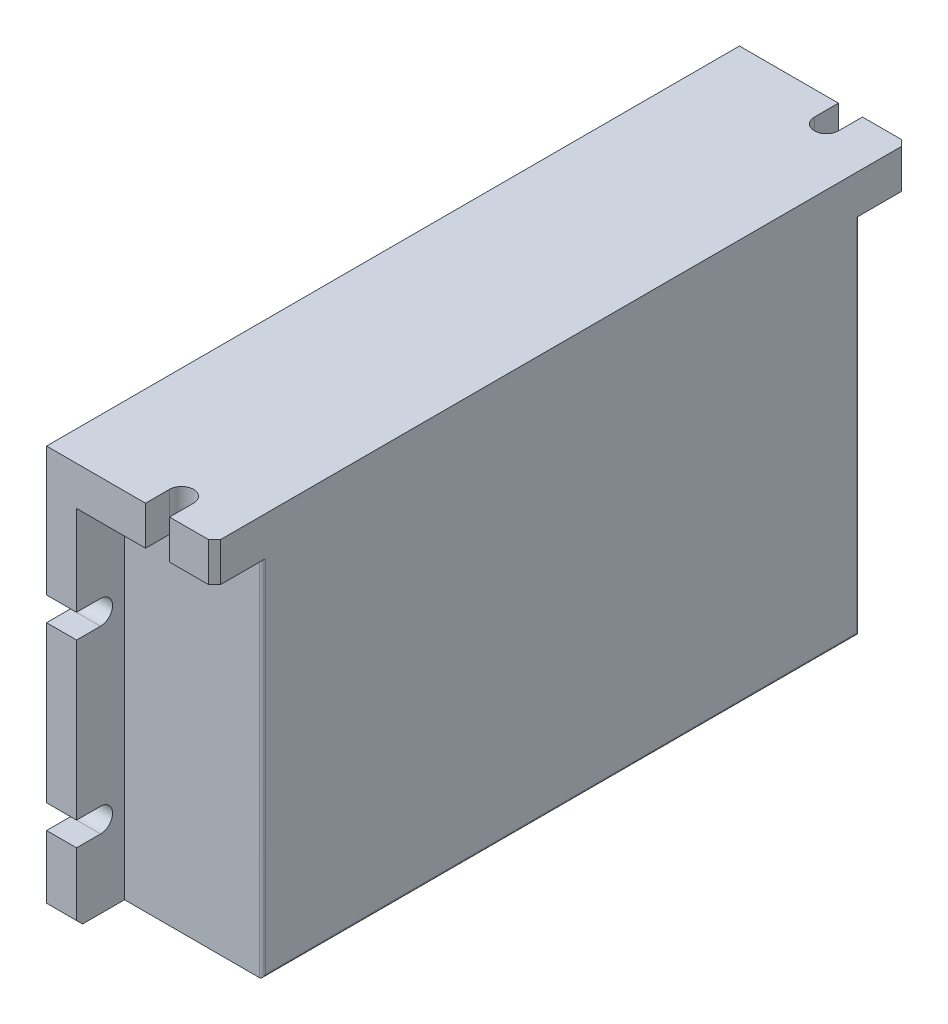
from build123d import *

# Parameters (mm, degrees)
SKETCH_1_W          = 115.5
SKETCH_1_H          = 67
EXTRUDE_1_DEPTH     = 28
SKETCH_2_W          = 8
SKETCH_2_H          = 60.5
CUT_EXTRUDE_1_DEPTH = 23
CUT_EXTRUDE_2_DEPTH = 6.5
CUT_EXTRUDE_3_DEPTH = 5
FILLET_1_R          = 0.5
CHAMFER_1_SIZE      = 1


with BuildPart() as part:
    # Sketch 1 → Extrude 1 (new body)
    with BuildSketch(Plane(origin=(0, 0, 0), x_dir=(0, 0, -1), z_dir=(1, 0, 0))):
        Rectangle(SKETCH_1_W, SKETCH_1_H)
    extrude(amount=EXTRUDE_1_DEPTH)

    # Sketch 2 → Cut-Extrude 1 (cut)
    with BuildSketch(Plane(origin=(28, 0, 0), x_dir=(0, 0, -1), z_dir=(1, 0, 0))):
        with Locations((-53.75, -3.25)):
            Rectangle(SKETCH_2_W, SKETCH_2_H)
        with Locations((53.75, -3.25)):
            Rectangle(SKETCH_2_W, SKETCH_2_H)
    extrude(amount=-CUT_EXTRUDE_1_DEPTH, mode=Mode.SUBTRACT)

    # Sketch 3 → Cut-Extrude 2 (cut)
    with BuildSketch(Plane(origin=(0, 33.5, 0), x_dir=(1, 0, 0), z_dir=(0, 1, 0))):
        with BuildLine():
            Line((16.5, 53.75), (16.5, 57.75))
            Line((16.5, 57.75), (20.5, 57.75))
            Line((20.5, 57.75), (20.5, 53.75))
            ThreePointArc((20.5, 53.75), (18.5, 51.75), (16.5, 53.75))
        make_face()
        with BuildLine():
            Line((16.5, -53.75), (16.5, -57.75))
            Line((16.5, -57.75), (20.5, -57.75))
            Line((20.5, -57.75), (20.5, -53.75))
            ThreePointArc((20.5, -53.75), (18.5, -51.75), (16.5, -53.75))
        make_face()
    extrude(amount=-CUT_EXTRUDE_2_DEPTH, mode=Mode.SUBTRACT)

    # Sketch 4 → Cut-Extrude 3 (cut)
    with BuildSketch(Plane(origin=(5, 0, 0), x_dir=(0, 0, -1), z_dir=(1, 0, 0))):
        with BuildLine():
            Line((-53.75, -18), (-57.75, -18))
            Line((-57.75, -18), (-57.75, -22))
            Line((-57.75, -22), (-53.75, -22))
            ThreePointArc((-53.75, -22), (-51.75, -20), (-53.75, -18))
        make_face()
        with BuildLine():
            Line((-53.75, 8), (-57.75, 8))
            Line((-57.75, 8), (-57.75, 12))
            Line((-57.75, 12), (-53.75, 12))
            ThreePointArc((-53.75, 12), (-51.75, 10), (-53.75, 8))
        make_face()
        with BuildLine():
            Line((53.75, -18), (57.75, -18))
            Line((57.75, -18), (57.75, -22))
            Line((57.75, -22), (53.75, -22))
            ThreePointArc((53.75, -22), (51.75, -20), (53.75, -18))
        make_face()
        with BuildLine():
            Line((53.75, 12), (57.75, 12))
            Line((57.75, 12), (57.75, 8))
            Line((57.75, 8), (53.75, 8))
            ThreePointArc((53.75, 8), (51.75, 10), (53.75, 12))
        make_face()
    extrude(amount=-CUT_EXTRUDE_3_DEPTH, mode=Mode.SUBTRACT)

    # Fillet 1
    fillet_1_edges = [part.edges().sort_by_distance(p)[0] for p in [
        (28, -33.5, 0),
        (28, -3.25, 49.75),
        (28, -3.25, -49.75),
    ]]
    fillet(fillet_1_edges, radius=FILLET_1_R)

    # Chamfer 1
    chamfer_1_edges = [part.edges().sort_by_distance(p)[0] for p in [
        (28, 30.25, 57.75),
        (2.5, -33.5, 57.75),
        (28, 30.25, -57.75),
        (2.5, -33.5, -57.75),
    ]]
    chamfer(chamfer_1_edges, length=CHAMFER_1_SIZE)


solid = part.part
